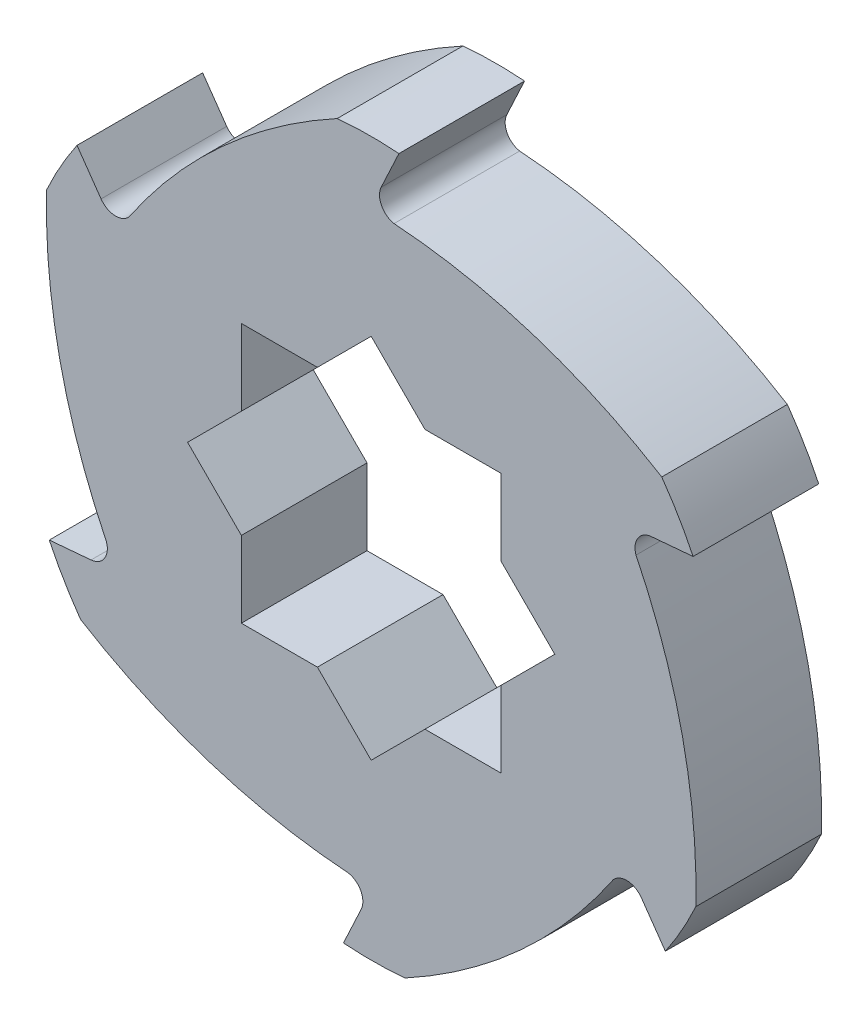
from build123d import *

# Parameters (mm, degrees)
BOSS_EXTRUDE1_DEPTH = 15


with BuildPart() as part:
    # Sketch1 → Boss-Extrude1 (new body)
    with BuildSketch(Plane(origin=(0, 0, -1.05), x_dir=(-1, 0, 0), z_dir=(0, 0, -1))):
        with BuildLine():
            Line((35.125703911, 24.102799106), (32.253314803, 20.000602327))
            ThreePointArc((32.253314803, 20.000602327), (30.615165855, 19.094991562), (28.894659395, 19.832229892))
            ThreePointArc((28.894659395, 19.832229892), (17.838778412, 32.615956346), (4.061538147, 42.405941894))
            ThreePointArc((4.061538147, 42.405941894), (0.376790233, 42.598333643), (-3.310784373, 42.471151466))
            Line((-3.310784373, 42.471151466), (-1.194372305, 37.932491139))
            ThreePointArc((-1.194372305, 37.932491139), (-1.22916485, 36.061007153), (-2.727885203, 34.939624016))
            ThreePointArc((-2.727885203, 34.939624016), (-19.326857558, 31.75681345), (-34.693853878, 24.720366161))
            ThreePointArc((-34.693853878, 24.720366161), (-36.702843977, 21.625476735), (-38.436488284, 18.36835236))
            Line((-38.436488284, 18.36835236), (-33.447687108, 17.931888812))
            ThreePointArc((-33.447687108, 17.931888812), (-31.844330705, 16.96601559), (-31.622544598, 15.107394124))
            ThreePointArc((-31.622544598, 15.107394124), (-37.16563597, -0.859142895), (-38.755392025, -17.685575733))
            ThreePointArc((-38.755392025, -17.685575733), (-37.07963421, -20.972856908), (-35.125703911, -24.102799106))
            Line((-35.125703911, -24.102799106), (-32.253314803, -20.000602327))
            ThreePointArc((-32.253314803, -20.000602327), (-30.615165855, -19.094991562), (-28.894659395, -19.832229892))
            ThreePointArc((-28.894659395, -19.832229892), (-17.838778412, -32.615956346), (-4.061538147, -42.405941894))
            ThreePointArc((-4.061538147, -42.405941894), (-0.376790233, -42.598333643), (3.310784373, -42.471151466))
            Line((3.310784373, -42.471151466), (1.194372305, -37.932491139))
            ThreePointArc((1.194372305, -37.932491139), (1.22916485, -36.061007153), (2.727885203, -34.939624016))
            ThreePointArc((2.727885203, -34.939624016), (19.326857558, -31.75681345), (34.693853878, -24.720366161))
            ThreePointArc((34.693853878, -24.720366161), (36.702843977, -21.625476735), (38.436488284, -18.36835236))
            Line((38.436488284, -18.36835236), (33.447687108, -17.931888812))
            ThreePointArc((33.447687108, -17.931888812), (31.844330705, -16.96601559), (31.622544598, -15.107394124))
            ThreePointArc((31.622544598, -15.107394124), (37.16563597, 0.859142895), (38.755392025, 17.685575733))
            ThreePointArc((38.755392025, 17.685575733), (37.07963421, 20.972856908), (35.125703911, 24.102799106))
        make_face()
        Polygon((-15.5, 6.420310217), (-15.5, 15.5), (-6.420310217, 15.5), (0, 21.920310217), (6.420310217, 15.5), (15.5, 15.5), (15.5, 6.420310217), (21.920310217, 0), (15.5, -6.420310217), (15.5, -15.5), (6.420310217, -15.5), (0, -21.920310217), (-6.420310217, -15.5), (-15.5, -15.5), (-15.5, -6.420310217), (-21.920310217, 0), align=None, mode=Mode.SUBTRACT)
    extrude(amount=-BOSS_EXTRUDE1_DEPTH)


solid = part.part
